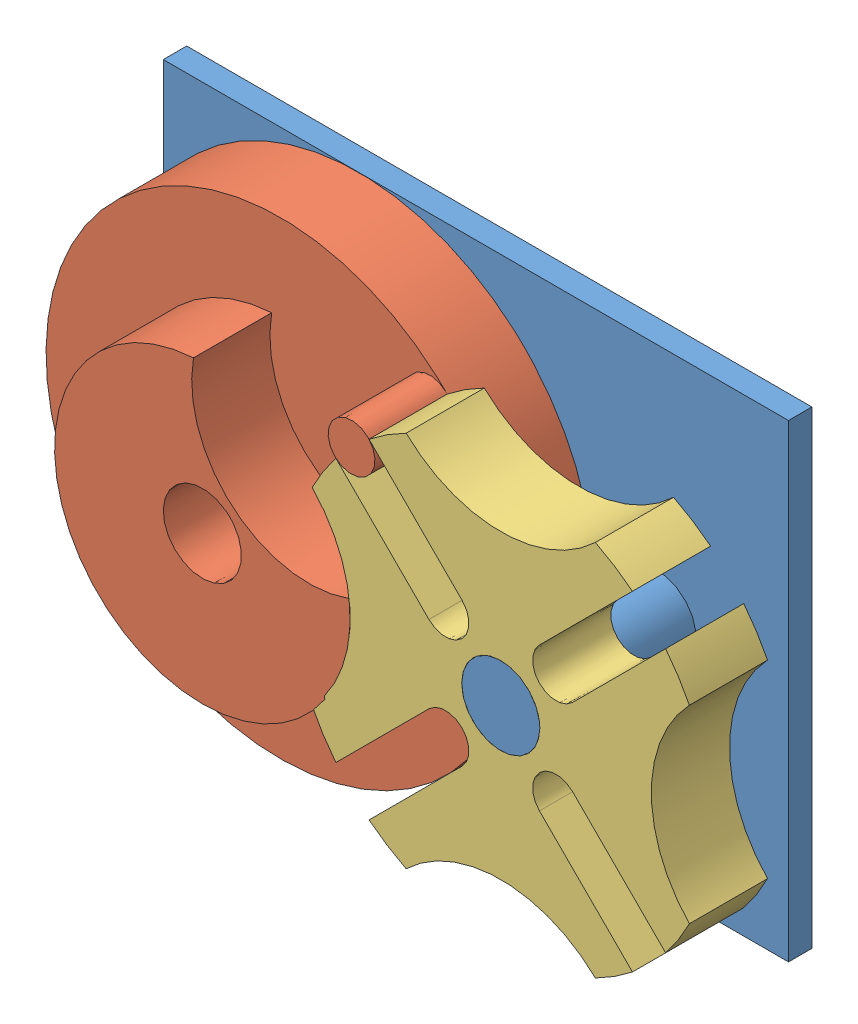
SolidWorks assembly Ass_croix de malte.SLDASM, configuration Défaut (file format 11000). Lengths in mm.
Overall size (118.56 84.85 23).
3 component instances, 3 part files, 6 mates.
Components (placement in the parent):
- sol-1: sol.SLDPRT [Défaut] at (-25.1161 -19.9368 0) size (80 60 23)
- plateau-1: plateau.SLDPRT [Défaut] at (-0.1161 10.0632 3) x (0.707107 0.707107 0) z (0 0 1) size (60 60 20)
- croix-1: croix.SLDPRT [Défaut] at (38.0677 10.0632 13) x (0.707107 0.707107 0) z (0 0 1) size (53.67 53.67 10)
Mates (geometry in assembly coordinates):
- Coïncidente1: coincident: plane of sol-1 through (-25.1161 40.0632 3) normal (0 0 1); plane of plateau-1 through (-0.1161 10.0632 3) normal (0 0 -1)
- Coaxiale1: concentric: cylinder of sol-1 through (-0.1161 10.0632 13) axis (0 0 -1) radius 5; cylinder of plateau-1 through (-0.1161 10.0632 13) axis (0 0 -1) radius 5
- Coaxiale2: concentric: cylinder of sol-1 through (38.0677 10.0632 13) axis (0 0 -1) radius 5; cylinder of croix-1 through (38.0677 10.0632 23) axis (0 0 -1) radius 5
- Coïncidente2: coincident: plane of sol-1 through (38.0677 10.0632 23) normal (0 0 1); plane of croix-1 through (38.0677 10.0632 23) normal (0 0 1)
- Tangent2: tangent: cylinder of plateau-1 through (18.9758 29.155 23) axis (0 0 -1) radius 3; plane of croix-1 through (28.8753 15.0129 13) normal (0.707107 0.707107 0)
- Coïncidente4: coincident: axis of plateau-1 through (18.9758 29.155 23) axis (0 0 -1); cylinder of croix-1 through (38.0677 10.0632 23) axis (0 0 -1) radius 27
